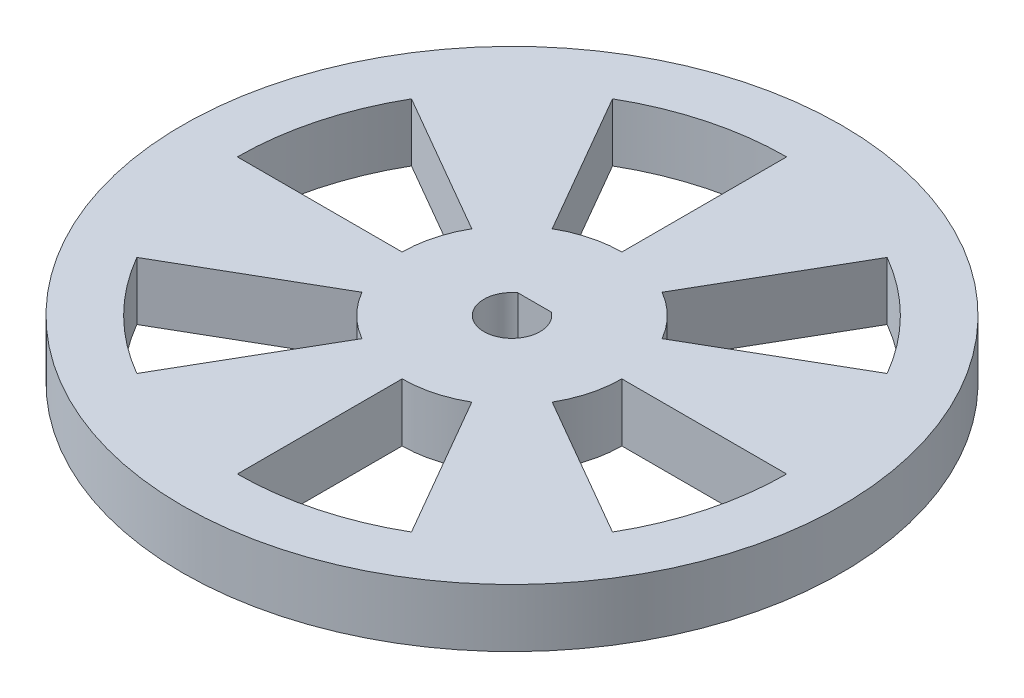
from build123d import *

# Parameters (mm, degrees)
SKETCH1_R      = 36
EXTRUDE1_DEPTH = 6.35


with BuildPart() as part:
    # Sketch1 → Extrude1 (new body)
    with BuildSketch(Plane(origin=(0, 0, 0), x_dir=(1, 0, 0), z_dir=(0, 1, 0))):
        with Locations(Location((0, 0, 0), (0, 0, 270))):
            Circle(SKETCH1_R)
        with BuildLine():
            Line((0, -12), (0, -30))
            ThreePointArc((0, -30), (7.764571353, -28.977774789), (15, -25.980762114))
            Line((15, -25.980762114), (6, -10.392304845))
            ThreePointArc((6, -10.392304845), (3.105828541, -11.591109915), (0, -12))
        make_face(mode=Mode.SUBTRACT)
        with BuildLine():
            Line((-6, 10.392304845), (-15, 25.980762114))
            ThreePointArc((-15, 25.980762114), (-7.764571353, 28.977774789), (0, 30))
            Line((0, 30), (0, 12))
            ThreePointArc((0, 12), (-3.105828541, 11.591109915), (-6, 10.392304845))
        make_face(mode=Mode.SUBTRACT)
        with BuildLine():
            Line((-10.392304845, 6), (-25.980762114, 15))
            ThreePointArc((-25.980762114, 15), (-28.977774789, 7.764571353), (-30, 0))
            Line((-30, 0), (-12, 0))
            ThreePointArc((-12, 0), (-11.591109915, 3.105828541), (-10.392304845, 6))
        make_face(mode=Mode.SUBTRACT)
        with BuildLine():
            Line((1.831876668, 2.46356), (-1.831876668, 2.46356))
            ThreePointArc((-1.831876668, 2.46356), (0, -3.07), (1.831876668, 2.46356))
        make_face(mode=Mode.SUBTRACT)
        with BuildLine():
            Line((10.392304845, 6), (25.980762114, 15))
            ThreePointArc((25.980762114, 15), (21.213203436, 21.213203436), (15, 25.980762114))
            Line((15, 25.980762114), (6, 10.392304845))
            ThreePointArc((6, 10.392304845), (8.485281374, 8.485281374), (10.392304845, 6))
        make_face(mode=Mode.SUBTRACT)
        with BuildLine():
            Line((10.392304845, -6), (25.980762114, -15))
            ThreePointArc((25.980762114, -15), (28.977774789, -7.764571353), (30, 0))
            Line((30, 0), (12, 0))
            ThreePointArc((12, 0), (11.591109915, -3.105828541), (10.392304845, -6))
        make_face(mode=Mode.SUBTRACT)
        with BuildLine():
            Line((-10.392304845, -6), (-25.980762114, -15))
            ThreePointArc((-25.980762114, -15), (-21.213203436, -21.213203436), (-15, -25.980762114))
            Line((-15, -25.980762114), (-6, -10.392304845))
            ThreePointArc((-6, -10.392304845), (-8.485281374, -8.485281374), (-10.392304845, -6))
        make_face(mode=Mode.SUBTRACT)
    extrude(amount=EXTRUDE1_DEPTH)


solid = part.part
